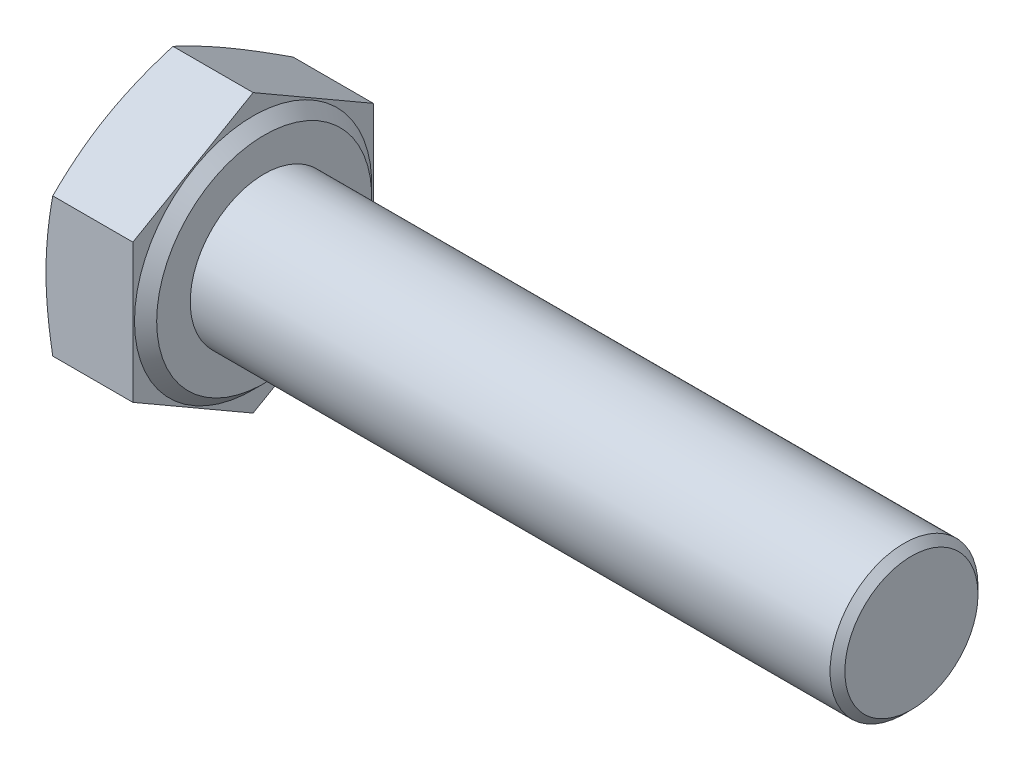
ISO-10303-21;
HEADER;
FILE_DESCRIPTION(('STEP AP214'),'2;1');
FILE_NAME('part.step','',(''),(''),'','','');
FILE_SCHEMA(('AUTOMOTIVE_DESIGN { 1 0 10303 214 1 1 1 1 }'));
ENDSEC;
DATA;
#1=APPLICATION_CONTEXT('core data for automotive mechanical design processes');
#2=APPLICATION_PROTOCOL_DEFINITION('international standard','automotive_design',2000,#1);
#3=PRODUCT_CONTEXT('',#1,'mechanical');
#4=PRODUCT('Part','Part','',(#3));
#5=PRODUCT_RELATED_PRODUCT_CATEGORY('part','',(#4));
#6=PRODUCT_DEFINITION_FORMATION('','',#4);
#7=PRODUCT_DEFINITION_CONTEXT('part definition',#1,'design');
#8=PRODUCT_DEFINITION('design','',#6,#7);
#9=PRODUCT_DEFINITION_SHAPE('','',#8);
#10=(LENGTH_UNIT() NAMED_UNIT(*) SI_UNIT(.MILLI.,.METRE.));
#11=(NAMED_UNIT(*) PLANE_ANGLE_UNIT() SI_UNIT($,.RADIAN.));
#12=(NAMED_UNIT(*) SI_UNIT($,.STERADIAN.) SOLID_ANGLE_UNIT());
#13=UNCERTAINTY_MEASURE_WITH_UNIT(LENGTH_MEASURE(1.E-05),#10,'distance_accuracy_value','');
#14=(GEOMETRIC_REPRESENTATION_CONTEXT(3) GLOBAL_UNCERTAINTY_ASSIGNED_CONTEXT((#13)) GLOBAL_UNIT_ASSIGNED_CONTEXT((#10,
#11,#12)) REPRESENTATION_CONTEXT('',''));
#15=CARTESIAN_POINT('',(0.,0.,0.));
#16=DIRECTION('',(0.,0.,1.));
#17=DIRECTION('',(1.,0.,0.));
#18=AXIS2_PLACEMENT_3D('',#15,#16,#17);
#19=CARTESIAN_POINT('',(5.3,-7.50555349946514,0.));
#20=DIRECTION('',(1.,0.,0.));
#21=DIRECTION('',(0.,0.,-1.));
#22=AXIS2_PLACEMENT_3D('',#19,#20,#21);
#23=PLANE('',#22);
#24=CARTESIAN_POINT('',(5.3,0.,0.));
#25=DIRECTION('',(-1.,0.,0.));
#26=DIRECTION('',(0.,0.,1.));
#27=AXIS2_PLACEMENT_3D('',#24,#25,#26);
#28=CIRCLE('',#27,5.815);
#29=CARTESIAN_POINT('',(5.3,0.,5.815));
#30=VERTEX_POINT('',#29);
#31=EDGE_CURVE('E266',#30,#30,#28,.T.);
#32=ORIENTED_EDGE('',*,*,#31,.F.);
#33=EDGE_LOOP('',(#32));
#34=FACE_BOUND('',#33,.T.);
#35=CARTESIAN_POINT('',(5.3,0.,0.));
#36=DIRECTION('',(1.,0.,0.));
#37=DIRECTION('',(0.,0.,-1.));
#38=AXIS2_PLACEMENT_3D('',#35,#36,#37);
#39=CIRCLE('',#38,4.);
#40=CARTESIAN_POINT('',(5.3,0.,-4.));
#41=VERTEX_POINT('',#40);
#42=EDGE_CURVE('E422',#41,#41,#39,.T.);
#43=ORIENTED_EDGE('',*,*,#42,.F.);
#44=EDGE_LOOP('',(#43));
#45=FACE_BOUND('',#44,.T.);
#46=ADVANCED_FACE('F43',(#34,#45),#23,.T.);
#47=CARTESIAN_POINT('',(5.3,-3.75277674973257,6.5));
#48=DIRECTION('',(0.,0.866025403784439,-0.5));
#49=DIRECTION('',(0.,0.5,0.866025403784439));
#50=AXIS2_PLACEMENT_3D('',#47,#48,#49);
#51=PLANE('',#50);
#52=CARTESIAN_POINT('',(0.36603357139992,-7.50566896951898,-0.000199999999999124));
#53=CARTESIAN_POINT('',(0.309444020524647,-7.35024872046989,0.268995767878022));
#54=CARTESIAN_POINT('',(0.257966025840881,-7.19431596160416,0.539079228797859));
#55=CARTESIAN_POINT('',(0.16739845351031,-6.88143655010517,1.08100226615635));
#56=CARTESIAN_POINT('',(0.1283185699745,-6.724489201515,1.35284304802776));
#57=CARTESIAN_POINT('',(0.0651079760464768,-6.41132237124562,1.89526390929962));
#58=CARTESIAN_POINT('',(0.0408393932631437,-6.25511004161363,2.16583160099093));
#59=CARTESIAN_POINT('',(0.00828840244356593,-5.94232007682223,2.70759971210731));
#60=CARTESIAN_POINT('',(0.,-5.78574260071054,2.97879985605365));
#61=CARTESIAN_POINT('',(0.,-5.47258764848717,3.52120014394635));
#62=CARTESIAN_POINT('',(0.00828840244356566,-5.31601017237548,3.79240028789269));
#63=CARTESIAN_POINT('',(0.0408393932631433,-5.00322020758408,4.33416839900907));
#64=CARTESIAN_POINT('',(0.0651079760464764,-4.84700787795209,4.60473609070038));
#65=CARTESIAN_POINT('',(0.128318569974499,-4.53384104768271,5.14715695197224));
#66=CARTESIAN_POINT('',(0.167398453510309,-4.37689369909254,5.41899773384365));
#67=CARTESIAN_POINT('',(0.257966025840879,-4.06401428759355,5.96092077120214));
#68=CARTESIAN_POINT('',(0.309444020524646,-3.90808152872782,6.23100423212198));
#69=CARTESIAN_POINT('',(0.366033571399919,-3.75266127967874,6.5002));
#70=B_SPLINE_CURVE_WITH_KNOTS('',3,(#52,#53,#54,#55,#56,#57,#58,#59,#60,#61,#62,#63,#64,#65,#66,
#67,#68,#69),.UNSPECIFIED.,.F.,.F.,(4,2,2,2,2,2,2,2,4),(0.,0.947946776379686,1.89663293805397,
2.83634783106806,3.77571015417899,4.71507247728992,5.65478737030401,6.6034735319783,
7.55142030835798),.UNSPECIFIED.);
#71=CARTESIAN_POINT('',(0.365991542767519,-7.50555349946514,0.));
#72=VERTEX_POINT('',#71);
#73=CARTESIAN_POINT('',(0.,-5.62916512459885,3.25));
#74=VERTEX_POINT('',#73);
#75=EDGE_CURVE('E180',#72,#74,#70,.T.);
#76=ORIENTED_EDGE('',*,*,#75,.F.);
#77=DIRECTION('',(-1.,0.,0.));
#78=VECTOR('',#77,1.);
#79=CARTESIAN_POINT('',(5.3,-7.50555349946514,0.));
#80=LINE('',#79,#78);
#81=CARTESIAN_POINT('',(4.7,-7.50555349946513,0.));
#82=VERTEX_POINT('',#81);
#83=EDGE_CURVE('E151',#82,#72,#80,.T.);
#84=ORIENTED_EDGE('',*,*,#83,.F.);
#85=DIRECTION('',(0.,-0.5,-0.866025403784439));
#86=VECTOR('',#85,1.);
#87=CARTESIAN_POINT('',(4.7,-3.75277674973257,6.5));
#88=LINE('',#87,#86);
#89=CARTESIAN_POINT('',(4.7,-3.75277674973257,6.5));
#90=VERTEX_POINT('',#89);
#91=EDGE_CURVE('E141',#90,#82,#88,.T.);
#92=ORIENTED_EDGE('',*,*,#91,.F.);
#93=DIRECTION('',(-1.,0.,0.));
#94=VECTOR('',#93,1.);
#95=CARTESIAN_POINT('',(5.3,-3.75277674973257,6.5));
#96=LINE('',#95,#94);
#97=CARTESIAN_POINT('',(0.365991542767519,-3.75277674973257,6.5));
#98=VERTEX_POINT('',#97);
#99=EDGE_CURVE('E140',#90,#98,#96,.T.);
#100=ORIENTED_EDGE('',*,*,#99,.T.);
#101=EDGE_CURVE('E134',#74,#98,#70,.T.);
#102=ORIENTED_EDGE('',*,*,#101,.F.);
#103=EDGE_LOOP('',(#76,#84,#92,#100,#102));
#104=FACE_BOUND('',#103,.T.);
#105=ADVANCED_FACE('F246',(#104),#51,.F.);
#106=CARTESIAN_POINT('',(5.3,-7.50555349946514,0.));
#107=DIRECTION('',(0.,0.866025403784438,0.5));
#108=DIRECTION('',(0.,-0.500000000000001,0.866025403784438));
#109=AXIS2_PLACEMENT_3D('',#106,#107,#108);
#110=PLANE('',#109);
#111=CARTESIAN_POINT('',(0.366033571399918,-3.75266127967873,-6.5002));
#112=CARTESIAN_POINT('',(0.309444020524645,-3.90808152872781,-6.23100423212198));
#113=CARTESIAN_POINT('',(0.257966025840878,-4.06401428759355,-5.96092077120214));
#114=CARTESIAN_POINT('',(0.167398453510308,-4.37689369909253,-5.41899773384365));
#115=CARTESIAN_POINT('',(0.128318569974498,-4.53384104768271,-5.14715695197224));
#116=CARTESIAN_POINT('',(0.0651079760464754,-4.84700787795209,-4.60473609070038));
#117=CARTESIAN_POINT('',(0.0408393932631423,-5.00322020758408,-4.33416839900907));
#118=CARTESIAN_POINT('',(0.0082884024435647,-5.31601017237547,-3.79240028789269));
#119=CARTESIAN_POINT('',(0.,-5.47258764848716,-3.52120014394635));
#120=CARTESIAN_POINT('',(0.,-5.78574260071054,-2.97879985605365));
#121=CARTESIAN_POINT('',(0.008288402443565,-5.94232007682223,-2.7075997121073));
#122=CARTESIAN_POINT('',(0.040839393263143,-6.25511004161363,-2.16583160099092));
#123=CARTESIAN_POINT('',(0.0651079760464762,-6.41132237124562,-1.89526390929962));
#124=CARTESIAN_POINT('',(0.128318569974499,-6.724489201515,-1.35284304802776));
#125=CARTESIAN_POINT('',(0.167398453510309,-6.88143655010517,-1.08100226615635));
#126=CARTESIAN_POINT('',(0.25796602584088,-7.19431596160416,-0.539079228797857));
#127=CARTESIAN_POINT('',(0.309444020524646,-7.35024872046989,-0.26899576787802));
#128=CARTESIAN_POINT('',(0.36603357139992,-7.50566896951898,0.000200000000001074));
#129=B_SPLINE_CURVE_WITH_KNOTS('',3,(#111,#112,#113,#114,#115,#116,#117,#118,#119,#120,#121,
#122,#123,#124,#125,#126,#127,#128),.UNSPECIFIED.,.F.,.F.,(4,2,2,2,2,2,2,2,4),(0.,
0.947946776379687,1.89663293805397,2.83634783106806,3.775710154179,4.71507247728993,
5.65478737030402,6.6034735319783,7.55142030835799),.UNSPECIFIED.);
#130=CARTESIAN_POINT('',(0.365991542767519,-3.75277674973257,-6.5));
#131=VERTEX_POINT('',#130);
#132=CARTESIAN_POINT('',(0.,-5.62916512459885,-3.25));
#133=VERTEX_POINT('',#132);
#134=EDGE_CURVE('E182',#131,#133,#129,.T.);
#135=ORIENTED_EDGE('',*,*,#134,.F.);
#136=DIRECTION('',(-1.,0.,0.));
#137=VECTOR('',#136,1.);
#138=CARTESIAN_POINT('',(5.3,-3.75277674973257,-6.5));
#139=LINE('',#138,#137);
#140=CARTESIAN_POINT('',(4.7,-3.75277674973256,-6.5));
#141=VERTEX_POINT('',#140);
#142=EDGE_CURVE('E146',#141,#131,#139,.T.);
#143=ORIENTED_EDGE('',*,*,#142,.F.);
#144=DIRECTION('',(0.,0.500000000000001,-0.866025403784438));
#145=VECTOR('',#144,1.);
#146=CARTESIAN_POINT('',(4.7,-7.50555349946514,0.));
#147=LINE('',#146,#145);
#148=EDGE_CURVE('E279',#82,#141,#147,.T.);
#149=ORIENTED_EDGE('',*,*,#148,.F.);
#150=ORIENTED_EDGE('',*,*,#83,.T.);
#151=EDGE_CURVE('E174',#133,#72,#129,.T.);
#152=ORIENTED_EDGE('',*,*,#151,.F.);
#153=EDGE_LOOP('',(#135,#143,#149,#150,#152));
#154=FACE_BOUND('',#153,.T.);
#155=ADVANCED_FACE('F194',(#154),#110,.F.);
#156=CARTESIAN_POINT('',(5.3,-3.75277674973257,-6.5));
#157=DIRECTION('',(0.,0.,1.));
#158=DIRECTION('',(1.,0.,0.));
#159=AXIS2_PLACEMENT_3D('',#156,#157,#158);
#160=PLANE('',#159);
#161=CARTESIAN_POINT('',(1.95571366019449,-9.93603326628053,-6.5));
#162=CARTESIAN_POINT('',(1.86616534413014,-9.64194976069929,-6.5));
#163=CARTESIAN_POINT('',(1.77766194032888,-9.34754216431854,-6.5));
#164=CARTESIAN_POINT('',(1.60332300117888,-8.757913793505,-6.5));
#165=CARTESIAN_POINT('',(1.51748767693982,-8.46269295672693,-6.5));
#166=CARTESIAN_POINT('',(1.34892015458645,-7.87076780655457,-6.5));
#167=CARTESIAN_POINT('',(1.26619404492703,-7.57406175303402,-6.5));
#168=CARTESIAN_POINT('',(1.1048134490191,-6.97954593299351,-6.5));
#169=CARTESIAN_POINT('',(1.02615888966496,-6.68173618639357,-6.5));
#170=CARTESIAN_POINT('',(0.874868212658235,-6.08849459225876,-6.5));
#171=CARTESIAN_POINT('',(0.802169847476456,-5.79307869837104,-6.5));
#172=CARTESIAN_POINT('',(0.662962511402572,-5.20077688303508,-6.5));
#173=CARTESIAN_POINT('',(0.596453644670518,-4.90389093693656,-6.5));
#174=CARTESIAN_POINT('',(0.471175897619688,-4.30858258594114,-6.5));
#175=CARTESIAN_POINT('',(0.412404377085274,-4.01016074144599,-6.5));
#176=CARTESIAN_POINT('',(0.304390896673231,-3.41158450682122,-6.5));
#177=CARTESIAN_POINT('',(0.25514861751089,-3.11143017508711,-6.5));
#178=CARTESIAN_POINT('',(0.17306978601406,-2.54318752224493,-6.5));
#179=CARTESIAN_POINT('',(0.139012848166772,-2.27527713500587,-6.5));
#180=CARTESIAN_POINT('',(0.0813625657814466,-1.738323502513,-6.5));
#181=CARTESIAN_POINT('',(0.057768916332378,-1.46928029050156,-6.5));
#182=CARTESIAN_POINT('',(0.0221814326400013,-0.930606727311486,-6.5));
#183=CARTESIAN_POINT('',(0.0101793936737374,-0.660976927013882,-6.5));
#184=CARTESIAN_POINT('',(-0.00161720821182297,-0.121447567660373,-6.5));
#185=CARTESIAN_POINT('',(-0.00141185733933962,0.148451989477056,-6.5));
#186=CARTESIAN_POINT('',(0.0112271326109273,0.689329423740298,-6.5));
#187=CARTESIAN_POINT('',(0.023722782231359,0.960305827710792,-6.5));
#188=CARTESIAN_POINT('',(0.0603673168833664,1.50146271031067,-6.5));
#189=CARTESIAN_POINT('',(0.0845164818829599,1.7716431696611,-6.5));
#190=CARTESIAN_POINT('',(0.143338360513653,2.31107475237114,-6.5));
#191=CARTESIAN_POINT('',(0.178020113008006,2.58032487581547,-6.5));
#192=CARTESIAN_POINT('',(0.256500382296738,3.11747812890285,-6.5));
#193=CARTESIAN_POINT('',(0.300298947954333,3.38538125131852,-6.5));
#194=CARTESIAN_POINT('',(0.3981077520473,3.93393829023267,-6.5));
#195=CARTESIAN_POINT('',(0.452535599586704,4.21451708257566,-6.5));
#196=CARTESIAN_POINT('',(0.568396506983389,4.77423382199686,-6.5));
#197=CARTESIAN_POINT('',(0.629830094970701,5.05337165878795,-6.5));
#198=CARTESIAN_POINT('',(0.758412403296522,5.61040543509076,-6.5));
#199=CARTESIAN_POINT('',(0.825562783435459,5.88830098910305,-6.5));
#200=CARTESIAN_POINT('',(0.964486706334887,6.4429213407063,-6.5));
#201=CARTESIAN_POINT('',(1.03626013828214,6.71964616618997,-6.5));
#202=CARTESIAN_POINT('',(1.18365887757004,7.27244360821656,-6.5));
#203=CARTESIAN_POINT('',(1.25928899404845,7.54851493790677,-6.5));
#204=CARTESIAN_POINT('',(1.41363071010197,8.09979648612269,-6.5));
#205=CARTESIAN_POINT('',(1.4923423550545,8.37500669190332,-6.5));
#206=CARTESIAN_POINT('',(1.73221572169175,9.19944068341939,-6.5));
#207=CARTESIAN_POINT('',(1.8971430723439,9.74756811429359,-6.5));
#208=CARTESIAN_POINT('',(2.2320227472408,10.8356486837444,-6.5));
#209=CARTESIAN_POINT('',(2.40189951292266,11.3756252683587,-6.5));
#210=CARTESIAN_POINT('',(2.74647925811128,12.4540616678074,-6.5));
#211=CARTESIAN_POINT('',(2.92118246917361,12.9925214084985,-6.5));
#212=CARTESIAN_POINT('',(3.27344644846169,14.0662400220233,-6.5));
#213=CARTESIAN_POINT('',(3.45099385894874,14.6015032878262,-6.5));
#214=CARTESIAN_POINT('',(3.71928531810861,15.4037138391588,-6.5));
#215=CARTESIAN_POINT('',(3.80904053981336,15.6709925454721,-6.5));
#216=CARTESIAN_POINT('',(3.98913176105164,16.2053535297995,-6.5));
#217=CARTESIAN_POINT('',(4.0794677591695,16.4724358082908,-6.5));
#218=CARTESIAN_POINT('',(4.17005521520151,16.7394327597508,-6.5));
#219=B_SPLINE_CURVE_WITH_KNOTS('',3,(#161,#162,#163,#164,#165,#166,#167,#168,#169,#170,#171,
#172,#173,#174,#175,#176,#177,#178,#179,#180,#181,#182,#183,#184,#185,#186,#187,#188,#189,#190,
#191,#192,#193,#194,#195,#196,#197,#198,#199,#200,#201,#202,#203,#204,#205,#206,#207,#208,#209,
#210,#211,#212,#213,#214,#215,#216,#217,#218),.UNSPECIFIED.,.F.,.F.,(4,2,2,2,2,2,2,2,2,2,2,2,2,
2,2,2,2,2,2,2,2,2,2,2,2,2,2,2,4),(0.,0.922251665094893,1.8445761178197,2.76862139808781,
3.69265008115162,4.60528596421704,5.51793720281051,6.43027620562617,7.34258463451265,
8.15260590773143,8.96260357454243,9.77202749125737,10.5814456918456,11.3949688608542,
12.2085115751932,13.0227544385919,13.8370016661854,14.694319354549,15.5517017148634,
16.4093338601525,17.2669454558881,18.1256539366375,18.9843750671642,20.7015057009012,
22.3996829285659,24.0979417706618,25.7897568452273,26.6355962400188,27.4814335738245),.UNSPECIFIED.);
#220=CARTESIAN_POINT('',(0.365991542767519,3.75277674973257,-6.5));
#221=VERTEX_POINT('',#220);
#222=CARTESIAN_POINT('',(0.,0.,-6.5));
#223=VERTEX_POINT('',#222);
#224=EDGE_CURVE('E281',#221,#223,#219,.F.);
#225=ORIENTED_EDGE('',*,*,#224,.F.);
#226=DIRECTION('',(-1.,0.,0.));
#227=VECTOR('',#226,1.);
#228=CARTESIAN_POINT('',(5.3,3.75277674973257,-6.5));
#229=LINE('',#228,#227);
#230=CARTESIAN_POINT('',(4.7,3.75277674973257,-6.5));
#231=VERTEX_POINT('',#230);
#232=EDGE_CURVE('E137',#231,#221,#229,.T.);
#233=ORIENTED_EDGE('',*,*,#232,.F.);
#234=DIRECTION('',(0.,1.,0.));
#235=VECTOR('',#234,1.);
#236=CARTESIAN_POINT('',(4.7,-3.75277674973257,-6.5));
#237=LINE('',#236,#235);
#238=EDGE_CURVE('E268',#141,#231,#237,.T.);
#239=ORIENTED_EDGE('',*,*,#238,.F.);
#240=ORIENTED_EDGE('',*,*,#142,.T.);
#241=EDGE_CURVE('E187',#223,#131,#219,.F.);
#242=ORIENTED_EDGE('',*,*,#241,.F.);
#243=EDGE_LOOP('',(#225,#233,#239,#240,#242));
#244=FACE_BOUND('',#243,.T.);
#245=ADVANCED_FACE('F251',(#244),#160,.F.);
#246=CARTESIAN_POINT('',(5.3,3.75277674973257,-6.5));
#247=DIRECTION('',(0.,-0.866025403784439,0.5));
#248=DIRECTION('',(0.,-0.5,-0.866025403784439));
#249=AXIS2_PLACEMENT_3D('',#246,#247,#248);
#250=PLANE('',#249);
#251=CARTESIAN_POINT('',(0.366033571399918,7.50566896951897,0.000199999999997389));
#252=CARTESIAN_POINT('',(0.309444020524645,7.35024872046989,-0.268995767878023));
#253=CARTESIAN_POINT('',(0.257966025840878,7.19431596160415,-0.539079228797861));
#254=CARTESIAN_POINT('',(0.167398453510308,6.88143655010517,-1.08100226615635));
#255=CARTESIAN_POINT('',(0.128318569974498,6.72448920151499,-1.35284304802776));
#256=CARTESIAN_POINT('',(0.0651079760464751,6.41132237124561,-1.89526390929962));
#257=CARTESIAN_POINT('',(0.0408393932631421,6.25511004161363,-2.16583160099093));
#258=CARTESIAN_POINT('',(0.00828840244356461,5.94232007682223,-2.70759971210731));
#259=CARTESIAN_POINT('',(0.,5.78574260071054,-2.97879985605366));
#260=CARTESIAN_POINT('',(0.,5.47258764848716,-3.52120014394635));
#261=CARTESIAN_POINT('',(0.00828840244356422,5.31601017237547,-3.7924002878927));
#262=CARTESIAN_POINT('',(0.0408393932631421,5.00322020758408,-4.33416839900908));
#263=CARTESIAN_POINT('',(0.0651079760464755,4.84700787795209,-4.60473609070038));
#264=CARTESIAN_POINT('',(0.128318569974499,4.53384104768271,-5.14715695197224));
#265=CARTESIAN_POINT('',(0.167398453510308,4.37689369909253,-5.41899773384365));
#266=CARTESIAN_POINT('',(0.257966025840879,4.06401428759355,-5.96092077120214));
#267=CARTESIAN_POINT('',(0.309444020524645,3.90808152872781,-6.23100423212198));
#268=CARTESIAN_POINT('',(0.366033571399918,3.75266127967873,-6.5002));
#269=B_SPLINE_CURVE_WITH_KNOTS('',3,(#251,#252,#253,#254,#255,#256,#257,#258,#259,#260,#261,
#262,#263,#264,#265,#266,#267,#268),.UNSPECIFIED.,.F.,.F.,(4,2,2,2,2,2,2,2,4),(0.,
0.947946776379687,1.89663293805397,2.83634783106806,3.77571015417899,4.71507247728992,
5.65478737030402,6.6034735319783,7.55142030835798),.UNSPECIFIED.);
#270=CARTESIAN_POINT('',(0.365991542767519,7.50555349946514,0.));
#271=VERTEX_POINT('',#270);
#272=CARTESIAN_POINT('',(0.,5.62916512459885,-3.25));
#273=VERTEX_POINT('',#272);
#274=EDGE_CURVE('E59',#271,#273,#269,.T.);
#275=ORIENTED_EDGE('',*,*,#274,.F.);
#276=DIRECTION('',(-1.,0.,0.));
#277=VECTOR('',#276,1.);
#278=CARTESIAN_POINT('',(5.3,7.50555349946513,0.));
#279=LINE('',#278,#277);
#280=CARTESIAN_POINT('',(4.7,7.50555349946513,0.));
#281=VERTEX_POINT('',#280);
#282=EDGE_CURVE('E136',#281,#271,#279,.T.);
#283=ORIENTED_EDGE('',*,*,#282,.F.);
#284=DIRECTION('',(0.,0.5,0.866025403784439));
#285=VECTOR('',#284,1.);
#286=CARTESIAN_POINT('',(4.7,3.75277674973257,-6.5));
#287=LINE('',#286,#285);
#288=EDGE_CURVE('E269',#231,#281,#287,.T.);
#289=ORIENTED_EDGE('',*,*,#288,.F.);
#290=ORIENTED_EDGE('',*,*,#232,.T.);
#291=EDGE_CURVE('E186',#273,#221,#269,.T.);
#292=ORIENTED_EDGE('',*,*,#291,.F.);
#293=EDGE_LOOP('',(#275,#283,#289,#290,#292));
#294=FACE_BOUND('',#293,.T.);
#295=ADVANCED_FACE('F261',(#294),#250,.F.);
#296=CARTESIAN_POINT('',(5.3,7.50555349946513,0.));
#297=DIRECTION('',(0.,-0.866025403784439,-0.5));
#298=DIRECTION('',(0.,0.5,-0.866025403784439));
#299=AXIS2_PLACEMENT_3D('',#296,#297,#298);
#300=PLANE('',#299);
#301=CARTESIAN_POINT('',(0.366033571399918,3.75266127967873,6.5002));
#302=CARTESIAN_POINT('',(0.309444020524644,3.90808152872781,6.23100423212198));
#303=CARTESIAN_POINT('',(0.257966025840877,4.06401428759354,5.96092077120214));
#304=CARTESIAN_POINT('',(0.167398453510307,4.37689369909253,5.41899773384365));
#305=CARTESIAN_POINT('',(0.128318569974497,4.53384104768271,5.14715695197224));
#306=CARTESIAN_POINT('',(0.0651079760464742,4.84700787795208,4.60473609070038));
#307=CARTESIAN_POINT('',(0.040839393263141,5.00322020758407,4.33416839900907));
#308=CARTESIAN_POINT('',(0.00828840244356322,5.31601017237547,3.79240028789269));
#309=CARTESIAN_POINT('',(0.,5.47258764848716,3.52120014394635));
#310=CARTESIAN_POINT('',(0.,5.78574260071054,2.97879985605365));
#311=CARTESIAN_POINT('',(0.00828840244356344,5.94232007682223,2.7075997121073));
#312=CARTESIAN_POINT('',(0.0408393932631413,6.25511004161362,2.16583160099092));
#313=CARTESIAN_POINT('',(0.0651079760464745,6.41132237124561,1.89526390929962));
#314=CARTESIAN_POINT('',(0.128318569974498,6.72448920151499,1.35284304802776));
#315=CARTESIAN_POINT('',(0.167398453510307,6.88143655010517,1.08100226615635));
#316=CARTESIAN_POINT('',(0.257966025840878,7.19431596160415,0.539079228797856));
#317=CARTESIAN_POINT('',(0.309444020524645,7.35024872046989,0.268995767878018));
#318=CARTESIAN_POINT('',(0.366033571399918,7.50566896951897,-0.000200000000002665));
#319=B_SPLINE_CURVE_WITH_KNOTS('',3,(#301,#302,#303,#304,#305,#306,#307,#308,#309,#310,#311,
#312,#313,#314,#315,#316,#317,#318),.UNSPECIFIED.,.F.,.F.,(4,2,2,2,2,2,2,2,4),(0.,
0.947946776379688,1.89663293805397,2.83634783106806,3.77571015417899,4.71507247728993,
5.65478737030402,6.6034735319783,7.55142030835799),.UNSPECIFIED.);
#320=CARTESIAN_POINT('',(0.365991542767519,3.75277674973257,6.5));
#321=VERTEX_POINT('',#320);
#322=CARTESIAN_POINT('',(0.,5.62916512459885,3.25));
#323=VERTEX_POINT('',#322);
#324=EDGE_CURVE('E69',#321,#323,#319,.T.);
#325=ORIENTED_EDGE('',*,*,#324,.F.);
#326=DIRECTION('',(-1.,0.,0.));
#327=VECTOR('',#326,1.);
#328=CARTESIAN_POINT('',(5.3,3.75277674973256,6.5));
#329=LINE('',#328,#327);
#330=CARTESIAN_POINT('',(4.7,3.75277674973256,6.5));
#331=VERTEX_POINT('',#330);
#332=EDGE_CURVE('E130',#331,#321,#329,.T.);
#333=ORIENTED_EDGE('',*,*,#332,.F.);
#334=DIRECTION('',(0.,-0.5,0.866025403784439));
#335=VECTOR('',#334,1.);
#336=CARTESIAN_POINT('',(4.7,7.50555349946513,0.));
#337=LINE('',#336,#335);
#338=EDGE_CURVE('E263',#281,#331,#337,.T.);
#339=ORIENTED_EDGE('',*,*,#338,.F.);
#340=ORIENTED_EDGE('',*,*,#282,.T.);
#341=EDGE_CURVE('E128',#323,#271,#319,.T.);
#342=ORIENTED_EDGE('',*,*,#341,.F.);
#343=EDGE_LOOP('',(#325,#333,#339,#340,#342));
#344=FACE_BOUND('',#343,.T.);
#345=ADVANCED_FACE('F127',(#344),#300,.F.);
#346=CARTESIAN_POINT('',(5.3,3.75277674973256,6.5));
#347=DIRECTION('',(0.,0.,-1.));
#348=DIRECTION('',(0.,1.,0.));
#349=AXIS2_PLACEMENT_3D('',#346,#347,#348);
#350=PLANE('',#349);
#351=CARTESIAN_POINT('',(1.9557136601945,-9.93603326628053,6.5));
#352=CARTESIAN_POINT('',(1.86616534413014,-9.6419497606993,6.5));
#353=CARTESIAN_POINT('',(1.77766194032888,-9.34754216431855,6.5));
#354=CARTESIAN_POINT('',(1.60332300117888,-8.757913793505,6.5));
#355=CARTESIAN_POINT('',(1.51748767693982,-8.46269295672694,6.5));
#356=CARTESIAN_POINT('',(1.34892015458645,-7.87076780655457,6.5));
#357=CARTESIAN_POINT('',(1.26619404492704,-7.57406175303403,6.5));
#358=CARTESIAN_POINT('',(1.1048134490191,-6.97954593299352,6.5));
#359=CARTESIAN_POINT('',(1.02615888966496,-6.68173618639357,6.5));
#360=CARTESIAN_POINT('',(0.874868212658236,-6.08849459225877,6.5));
#361=CARTESIAN_POINT('',(0.802169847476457,-5.79307869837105,6.5));
#362=CARTESIAN_POINT('',(0.662962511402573,-5.20077688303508,6.5));
#363=CARTESIAN_POINT('',(0.596453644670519,-4.90389093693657,6.5));
#364=CARTESIAN_POINT('',(0.471175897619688,-4.30858258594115,6.5));
#365=CARTESIAN_POINT('',(0.412404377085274,-4.01016074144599,6.5));
#366=CARTESIAN_POINT('',(0.304390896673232,-3.41158450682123,6.5));
#367=CARTESIAN_POINT('',(0.255148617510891,-3.11143017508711,6.5));
#368=CARTESIAN_POINT('',(0.17306978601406,-2.54318752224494,6.5));
#369=CARTESIAN_POINT('',(0.139012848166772,-2.27527713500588,6.5));
#370=CARTESIAN_POINT('',(0.0813625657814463,-1.73832350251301,6.5));
#371=CARTESIAN_POINT('',(0.0577689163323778,-1.46928029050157,6.5));
#372=CARTESIAN_POINT('',(0.0221814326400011,-0.930606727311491,6.5));
#373=CARTESIAN_POINT('',(0.0101793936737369,-0.660976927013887,6.5));
#374=CARTESIAN_POINT('',(-0.00161720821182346,-0.121447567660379,6.5));
#375=CARTESIAN_POINT('',(-0.00141185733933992,0.14845198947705,6.5));
#376=CARTESIAN_POINT('',(0.0112271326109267,0.689329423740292,6.5));
#377=CARTESIAN_POINT('',(0.0237227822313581,0.960305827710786,6.5));
#378=CARTESIAN_POINT('',(0.0603673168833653,1.50146271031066,6.5));
#379=CARTESIAN_POINT('',(0.084516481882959,1.7716431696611,6.5));
#380=CARTESIAN_POINT('',(0.143338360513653,2.31107475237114,6.5));
#381=CARTESIAN_POINT('',(0.178020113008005,2.58032487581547,6.5));
#382=CARTESIAN_POINT('',(0.256500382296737,3.11747812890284,6.5));
#383=CARTESIAN_POINT('',(0.300298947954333,3.38538125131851,6.5));
#384=CARTESIAN_POINT('',(0.398107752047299,3.93393829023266,6.5));
#385=CARTESIAN_POINT('',(0.452535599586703,4.21451708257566,6.5));
#386=CARTESIAN_POINT('',(0.568396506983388,4.77423382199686,6.5));
#387=CARTESIAN_POINT('',(0.6298300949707,5.05337165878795,6.5));
#388=CARTESIAN_POINT('',(0.758412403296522,5.61040543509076,6.5));
#389=CARTESIAN_POINT('',(0.82556278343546,5.88830098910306,6.5));
#390=CARTESIAN_POINT('',(0.964486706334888,6.4429213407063,6.5));
#391=CARTESIAN_POINT('',(1.03626013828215,6.71964616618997,6.5));
#392=CARTESIAN_POINT('',(1.18365887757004,7.27244360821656,6.5));
#393=CARTESIAN_POINT('',(1.25928899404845,7.54851493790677,6.5));
#394=CARTESIAN_POINT('',(1.41363071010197,8.09979648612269,6.5));
#395=CARTESIAN_POINT('',(1.4923423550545,8.37500669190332,6.5));
#396=CARTESIAN_POINT('',(1.73221572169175,9.1994406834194,6.5));
#397=CARTESIAN_POINT('',(1.89714307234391,9.74756811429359,6.5));
#398=CARTESIAN_POINT('',(2.2320227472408,10.8356486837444,6.5));
#399=CARTESIAN_POINT('',(2.40189951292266,11.3756252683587,6.5));
#400=CARTESIAN_POINT('',(2.74647925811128,12.4540616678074,6.5));
#401=CARTESIAN_POINT('',(2.92118246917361,12.9925214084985,6.5));
#402=CARTESIAN_POINT('',(3.27344644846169,14.0662400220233,6.5));
#403=CARTESIAN_POINT('',(3.45099385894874,14.6015032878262,6.5));
#404=CARTESIAN_POINT('',(3.71928531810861,15.4037138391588,6.5));
#405=CARTESIAN_POINT('',(3.80904053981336,15.6709925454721,6.5));
#406=CARTESIAN_POINT('',(3.98913176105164,16.2053535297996,6.5));
#407=CARTESIAN_POINT('',(4.07946775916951,16.4724358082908,6.5));
#408=CARTESIAN_POINT('',(4.17005521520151,16.7394327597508,6.5));
#409=B_SPLINE_CURVE_WITH_KNOTS('',3,(#351,#352,#353,#354,#355,#356,#357,#358,#359,#360,#361,
#362,#363,#364,#365,#366,#367,#368,#369,#370,#371,#372,#373,#374,#375,#376,#377,#378,#379,#380,
#381,#382,#383,#384,#385,#386,#387,#388,#389,#390,#391,#392,#393,#394,#395,#396,#397,#398,#399,
#400,#401,#402,#403,#404,#405,#406,#407,#408),.UNSPECIFIED.,.F.,.F.,(4,2,2,2,2,2,2,2,2,2,2,2,2,
2,2,2,2,2,2,2,2,2,2,2,2,2,2,2,4),(0.,0.922251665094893,1.84457611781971,2.76862139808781,
3.69265008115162,4.60528596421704,5.51793720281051,6.43027620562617,7.34258463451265,
8.15260590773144,8.96260357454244,9.77202749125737,10.5814456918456,11.3949688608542,
12.2085115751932,13.0227544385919,13.8370016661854,14.694319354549,15.5517017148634,
16.4093338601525,17.2669454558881,18.1256539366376,18.9843750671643,20.7015057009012,
22.3996829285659,24.0979417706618,25.7897568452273,26.6355962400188,27.4814335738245),.UNSPECIFIED.);
#410=CARTESIAN_POINT('',(0.,0.,6.5));
#411=VERTEX_POINT('',#410);
#412=EDGE_CURVE('E122',#98,#411,#409,.T.);
#413=ORIENTED_EDGE('',*,*,#412,.F.);
#414=ORIENTED_EDGE('',*,*,#99,.F.);
#415=DIRECTION('',(0.,-1.,0.));
#416=VECTOR('',#415,1.);
#417=CARTESIAN_POINT('',(4.7,3.75277674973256,6.5));
#418=LINE('',#417,#416);
#419=EDGE_CURVE('E139',#331,#90,#418,.T.);
#420=ORIENTED_EDGE('',*,*,#419,.F.);
#421=ORIENTED_EDGE('',*,*,#332,.T.);
#422=EDGE_CURVE('E113',#411,#321,#409,.T.);
#423=ORIENTED_EDGE('',*,*,#422,.F.);
#424=EDGE_LOOP('',(#413,#414,#420,#421,#423));
#425=FACE_BOUND('',#424,.T.);
#426=ADVANCED_FACE('F133',(#425),#350,.F.);
#427=CARTESIAN_POINT('',(4.7,6.41500000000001,0.));
#428=DIRECTION('',(1.,0.,0.));
#429=DIRECTION('',(0.,0.,-1.));
#430=AXIS2_PLACEMENT_3D('',#427,#428,#429);
#431=PLANE('',#430);
#432=CARTESIAN_POINT('',(4.7,0.,0.));
#433=DIRECTION('',(-1.,0.,0.));
#434=DIRECTION('',(0.,0.,1.));
#435=AXIS2_PLACEMENT_3D('',#432,#433,#434);
#436=CIRCLE('',#435,6.41500000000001);
#437=CARTESIAN_POINT('',(4.7,0.,6.41500000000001));
#438=VERTEX_POINT('',#437);
#439=EDGE_CURVE('E271',#438,#438,#436,.T.);
#440=ORIENTED_EDGE('',*,*,#439,.T.);
#441=EDGE_LOOP('',(#440));
#442=FACE_BOUND('',#441,.T.);
#443=ORIENTED_EDGE('',*,*,#91,.T.);
#444=ORIENTED_EDGE('',*,*,#148,.T.);
#445=ORIENTED_EDGE('',*,*,#238,.T.);
#446=ORIENTED_EDGE('',*,*,#288,.T.);
#447=ORIENTED_EDGE('',*,*,#338,.T.);
#448=ORIENTED_EDGE('',*,*,#419,.T.);
#449=EDGE_LOOP('',(#443,#444,#445,#446,#447,#448));
#450=FACE_BOUND('',#449,.T.);
#451=ADVANCED_FACE('F223',(#442,#450),#431,.T.);
#452=CARTESIAN_POINT('',(4.7,0.,0.));
#453=DIRECTION('',(-1.,0.,0.));
#454=DIRECTION('',(0.,0.,1.));
#455=AXIS2_PLACEMENT_3D('',#452,#453,#454);
#456=CONICAL_SURFACE('',#455,6.41500000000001,0.785398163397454);
#457=ORIENTED_EDGE('',*,*,#31,.T.);
#458=EDGE_LOOP('',(#457));
#459=FACE_BOUND('',#458,.T.);
#460=ORIENTED_EDGE('',*,*,#439,.F.);
#461=EDGE_LOOP('',(#460));
#462=FACE_BOUND('',#461,.T.);
#463=ADVANCED_FACE('F286',(#459,#462),#456,.T.);
#464=CARTESIAN_POINT('',(0.,0.,0.));
#465=DIRECTION('',(1.,0.,0.));
#466=DIRECTION('',(0.,0.,-1.));
#467=AXIS2_PLACEMENT_3D('',#464,#465,#466);
#468=CONICAL_SURFACE('',#467,6.5,1.22173047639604);
#469=ORIENTED_EDGE('',*,*,#241,.T.);
#470=ORIENTED_EDGE('',*,*,#134,.T.);
#471=CARTESIAN_POINT('',(0.,0.,0.));
#472=DIRECTION('',(1.,0.,0.));
#473=DIRECTION('',(0.,0.,-1.));
#474=AXIS2_PLACEMENT_3D('',#471,#472,#473);
#475=CIRCLE('',#474,6.5);
#476=EDGE_CURVE('E159',#133,#223,#475,.T.);
#477=ORIENTED_EDGE('',*,*,#476,.T.);
#478=EDGE_LOOP('',(#469,#470,#477));
#479=FACE_BOUND('',#478,.T.);
#480=ADVANCED_FACE('F183',(#479),#468,.T.);
#481=ORIENTED_EDGE('',*,*,#151,.T.);
#482=ORIENTED_EDGE('',*,*,#75,.T.);
#483=EDGE_CURVE('E160',#74,#133,#475,.T.);
#484=ORIENTED_EDGE('',*,*,#483,.T.);
#485=EDGE_LOOP('',(#481,#482,#484));
#486=FACE_BOUND('',#485,.T.);
#487=ADVANCED_FACE('F173',(#486),#468,.T.);
#488=ORIENTED_EDGE('',*,*,#101,.T.);
#489=ORIENTED_EDGE('',*,*,#412,.T.);
#490=EDGE_CURVE('E170',#411,#74,#475,.T.);
#491=ORIENTED_EDGE('',*,*,#490,.T.);
#492=EDGE_LOOP('',(#488,#489,#491));
#493=FACE_BOUND('',#492,.T.);
#494=ADVANCED_FACE('F331',(#493),#468,.T.);
#495=ORIENTED_EDGE('',*,*,#324,.T.);
#496=CARTESIAN_POINT('',(0.,0.,0.));
#497=DIRECTION('',(-1.,0.,0.));
#498=DIRECTION('',(0.,0.,1.));
#499=AXIS2_PLACEMENT_3D('',#496,#497,#498);
#500=CIRCLE('',#499,6.5);
#501=EDGE_CURVE('E116',#411,#323,#500,.T.);
#502=ORIENTED_EDGE('',*,*,#501,.F.);
#503=ORIENTED_EDGE('',*,*,#422,.T.);
#504=EDGE_LOOP('',(#495,#502,#503));
#505=FACE_BOUND('',#504,.T.);
#506=ADVANCED_FACE('F112',(#505),#468,.T.);
#507=ORIENTED_EDGE('',*,*,#274,.T.);
#508=EDGE_CURVE('E161',#273,#323,#475,.T.);
#509=ORIENTED_EDGE('',*,*,#508,.T.);
#510=ORIENTED_EDGE('',*,*,#341,.T.);
#511=EDGE_LOOP('',(#507,#509,#510));
#512=FACE_BOUND('',#511,.T.);
#513=ADVANCED_FACE('F224',(#512),#468,.T.);
#514=ORIENTED_EDGE('',*,*,#224,.T.);
#515=EDGE_CURVE('E158',#223,#273,#475,.T.);
#516=ORIENTED_EDGE('',*,*,#515,.T.);
#517=ORIENTED_EDGE('',*,*,#291,.T.);
#518=EDGE_LOOP('',(#514,#516,#517));
#519=FACE_BOUND('',#518,.T.);
#520=ADVANCED_FACE('F219',(#519),#468,.T.);
#521=CARTESIAN_POINT('',(0.,-7.50555349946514,0.));
#522=DIRECTION('',(1.,0.,0.));
#523=DIRECTION('',(0.,0.,-1.));
#524=AXIS2_PLACEMENT_3D('',#521,#522,#523);
#525=PLANE('',#524);
#526=ORIENTED_EDGE('',*,*,#515,.F.);
#527=ORIENTED_EDGE('',*,*,#476,.F.);
#528=ORIENTED_EDGE('',*,*,#483,.F.);
#529=ORIENTED_EDGE('',*,*,#490,.F.);
#530=ORIENTED_EDGE('',*,*,#501,.T.);
#531=ORIENTED_EDGE('',*,*,#508,.F.);
#532=EDGE_LOOP('',(#526,#527,#528,#529,#530,#531));
#533=FACE_BOUND('',#532,.T.);
#534=ADVANCED_FACE('F192',(#533),#525,.F.);
#535=CARTESIAN_POINT('',(40.3,0.,0.));
#536=DIRECTION('',(-1.,0.,0.));
#537=DIRECTION('',(0.,0.,1.));
#538=AXIS2_PLACEMENT_3D('',#535,#536,#537);
#539=CYLINDRICAL_SURFACE('',#538,4.);
#540=CARTESIAN_POINT('',(39.9,0.,0.));
#541=DIRECTION('',(1.,0.,0.));
#542=DIRECTION('',(0.,0.,-1.));
#543=AXIS2_PLACEMENT_3D('',#540,#541,#542);
#544=CIRCLE('',#543,4.);
#545=CARTESIAN_POINT('',(39.9,0.,-4.));
#546=VERTEX_POINT('',#545);
#547=EDGE_CURVE('E11',#546,#546,#544,.F.);
#548=ORIENTED_EDGE('',*,*,#547,.T.);
#549=EDGE_LOOP('',(#548));
#550=FACE_BOUND('',#549,.T.);
#551=ORIENTED_EDGE('',*,*,#42,.T.);
#552=EDGE_LOOP('',(#551));
#553=FACE_BOUND('',#552,.T.);
#554=ADVANCED_FACE('F221',(#550,#553),#539,.T.);
#555=CARTESIAN_POINT('',(40.3,0.,0.));
#556=DIRECTION('',(1.,0.,0.));
#557=DIRECTION('',(0.,0.,-1.));
#558=AXIS2_PLACEMENT_3D('',#555,#556,#557);
#559=PLANE('',#558);
#560=CARTESIAN_POINT('',(40.3,0.,0.));
#561=DIRECTION('',(1.,0.,0.));
#562=DIRECTION('',(0.,0.,-1.));
#563=AXIS2_PLACEMENT_3D('',#560,#561,#562);
#564=CIRCLE('',#563,3.60000000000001);
#565=CARTESIAN_POINT('',(40.3,0.,-3.60000000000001));
#566=VERTEX_POINT('',#565);
#567=EDGE_CURVE('E51',#566,#566,#564,.T.);
#568=ORIENTED_EDGE('',*,*,#567,.T.);
#569=EDGE_LOOP('',(#568));
#570=FACE_BOUND('',#569,.T.);
#571=ADVANCED_FACE('F372',(#570),#559,.T.);
#572=CARTESIAN_POINT('',(40.3,0.,0.));
#573=DIRECTION('',(-1.,0.,0.));
#574=DIRECTION('',(0.,0.,1.));
#575=AXIS2_PLACEMENT_3D('',#572,#573,#574);
#576=CONICAL_SURFACE('',#575,3.60000000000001,0.785398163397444);
#577=ORIENTED_EDGE('',*,*,#547,.F.);
#578=EDGE_LOOP('',(#577));
#579=FACE_BOUND('',#578,.T.);
#580=ORIENTED_EDGE('',*,*,#567,.F.);
#581=EDGE_LOOP('',(#580));
#582=FACE_BOUND('',#581,.T.);
#583=ADVANCED_FACE('F44',(#579,#582),#576,.T.);
#584=CLOSED_SHELL('',(#46,#105,#155,#245,#295,#345,#426,#451,#463,#480,#487,#494,#506,#513,#520,
#534,#554,#571,#583));
#585=MANIFOLD_SOLID_BREP('B2',#584);
#586=ADVANCED_BREP_SHAPE_REPRESENTATION('',(#18,#585),#14);
#587=SHAPE_DEFINITION_REPRESENTATION(#9,#586);
ENDSEC;
END-ISO-10303-21;
